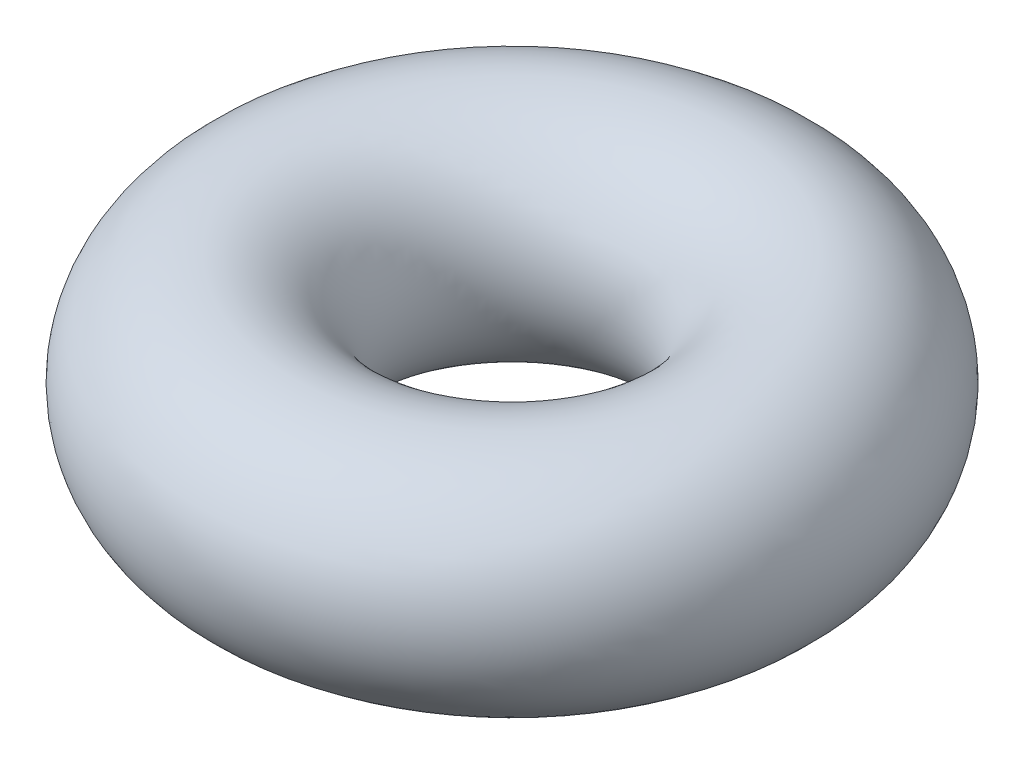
from build123d import *

# Parameters (mm, degrees)
SKETCH1_R   = 72.5
SKETCH1_R_2 = 62.5


with BuildPart() as part:
    # Sketch1 → Revolve-Thin1 (revolve)
    with BuildSketch(Plane.XY, mode=Mode.PRIVATE) as revolve_thin1_sk:
        Circle(SKETCH1_R)
        Circle(SKETCH1_R_2, mode=Mode.SUBTRACT)
    revolve(revolve_thin1_sk.sketch.rotate(Axis((141.530110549, 68.526968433, 0), (0, -1, 0)), 270), axis=Axis((141.530110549, 68.526968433, 0), (0, -1, 0)))


solid = part.part
